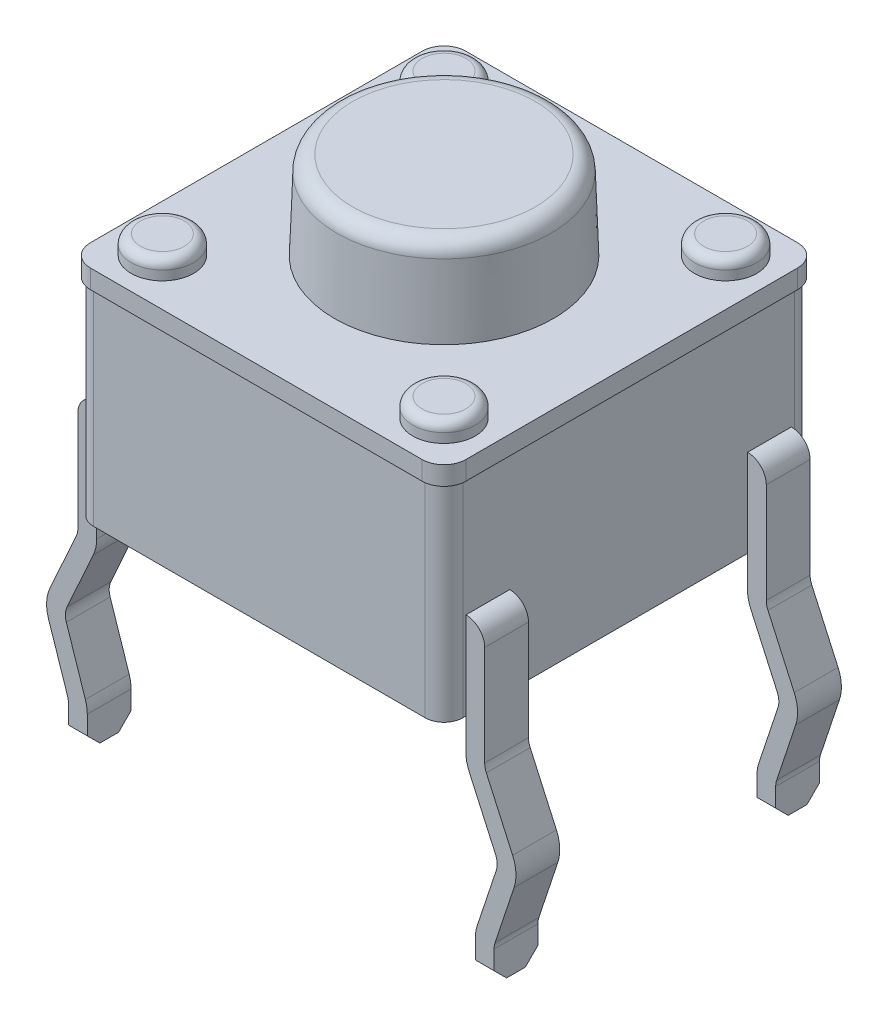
from build123d import *

# Parameters (mm, degrees)
EXTRUDE_1_DEPTH = 3.3
EXTRUDE_2_DEPTH = 0.3
EXTRUDE_START   = 2.25
EXTRUDE_3_DEPTH = 0.35
EXTRUDE_START_2 = -2.25
EXTRUDE_4_DEPTH = 0.35
CHAMFER_1_SIZE  = 0.2
SKETCH_4_R      = 1.75
EXTRUDE_5_DEPTH = 1.4
EXTRUDE_5_TAPER = 2
SKETCH_5_R      = 0.5
EXTRUDE_6_DEPTH = 0.3
FILLET_1_R      = 0.15
FILLET_2_R      = 0.25


with BuildPart() as part:
    # Sketch 1 → Extrude 1 (new body)
    with BuildSketch(Plane(origin=(0, 0, 0), x_dir=(1, 0, 0), z_dir=(0, 1, 0))):
        with BuildLine():
            Line((-2.65, -2.95), (2.65, -2.95))
            ThreePointArc((2.65, -2.95), (2.862132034, -2.862132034), (2.95, -2.65))
            Line((2.95, -2.65), (2.95, 2.65))
            ThreePointArc((2.95, 2.65), (2.862132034, 2.862132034), (2.65, 2.95))
            Line((2.65, 2.95), (-2.65, 2.95))
            ThreePointArc((-2.65, 2.95), (-2.862132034, 2.862132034), (-2.95, 2.65))
            Line((-2.95, 2.65), (-2.95, -2.65))
            ThreePointArc((-2.95, -2.65), (-2.862132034, -2.862132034), (-2.65, -2.95))
        make_face()
    extrude(amount=EXTRUDE_1_DEPTH)

    # Sketch 2 → Extrude 2 (add)
    with BuildSketch(Plane(origin=(0, 3.3, 0), x_dir=(-1, 0, 0), z_dir=(0, 1, 0))):
        with BuildLine():
            Line((3, -2.65), (3, 2.65))
            ThreePointArc((3, 2.65), (2.897487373, 2.897487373), (2.65, 3))
            Line((2.65, 3), (-2.65, 3))
            ThreePointArc((-2.65, 3), (-2.897487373, 2.897487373), (-3, 2.65))
            Line((-3, 2.65), (-3, -2.65))
            ThreePointArc((-3, -2.65), (-2.897487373, -2.897487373), (-2.65, -3))
            Line((-2.65, -3), (2.65, -3))
            ThreePointArc((2.65, -3), (2.897487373, -2.897487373), (3, -2.65))
        make_face()
    extrude(amount=EXTRUDE_2_DEPTH)

    # Sketch 3 → Extrude 3 (add, symmetric)
    with BuildSketch(Plane.XY.offset(EXTRUDE_START)):
        with BuildLine():
            Line((-2.95, 1.4), (-2.95, -0.5))
            ThreePointArc((-2.95, -0.5), (-2.963469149, -0.626418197), (-3.003271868, -0.747160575))
            Line((-3.003271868, -0.747160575), (-3.423364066, -1.676419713))
            ThreePointArc((-3.423364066, -1.676419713), (-3.449593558, -1.784389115), (-3.434727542, -1.894499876))
            Line((-3.434727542, -1.894499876), (-3.130544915, -2.811000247))
            ThreePointArc((-3.130544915, -2.811000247), (-3.107685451, -2.904273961), (-3.1, -3))
            Line((-3.1, -3), (-3.1, -3.5))
            Line((-3.1, -3.5), (-3.4, -3.5))
            Line((-3.4, -3.5), (-3.4, -3))
            ThreePointArc((-3.4, -3), (-3.403842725, -2.95213698), (-3.415272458, -2.905500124))
            Line((-3.415272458, -2.905500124), (-3.719455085, -1.988999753))
            ThreePointArc((-3.719455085, -1.988999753), (-3.749187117, -1.76877823), (-3.696728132, -1.552839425))
            Line((-3.696728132, -1.552839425), (-3.276635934, -0.623580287))
            ThreePointArc((-3.276635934, -0.623580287), (-3.256734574, -0.563209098), (-3.25, -0.5))
            Line((-3.25, -0.5), (-3.25, 1.1))
            ThreePointArc((-3.25, 1.1), (-3.162132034, 1.312132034), (-2.95, 1.4))
        make_face()
        with BuildLine():
            Line((3.4, -3.5), (3.1, -3.5))
            Line((3.1, -3.5), (3.1, -3))
            ThreePointArc((3.1, -3), (3.107685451, -2.904273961), (3.130544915, -2.811000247))
            Line((3.130544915, -2.811000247), (3.434727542, -1.894499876))
            ThreePointArc((3.434727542, -1.894499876), (3.449593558, -1.784389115), (3.423364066, -1.676419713))
            Line((3.423364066, -1.676419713), (3.003271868, -0.747160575))
            ThreePointArc((3.003271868, -0.747160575), (2.963469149, -0.626418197), (2.95, -0.5))
            Line((2.95, -0.5), (2.95, 1.4))
            ThreePointArc((2.95, 1.4), (3.162132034, 1.312132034), (3.25, 1.1))
            Line((3.25, 1.1), (3.25, -0.5))
            ThreePointArc((3.25, -0.5), (3.256734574, -0.563209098), (3.276635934, -0.623580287))
            Line((3.276635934, -0.623580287), (3.696728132, -1.552839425))
            ThreePointArc((3.696728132, -1.552839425), (3.749187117, -1.76877823), (3.719455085, -1.988999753))
            Line((3.719455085, -1.988999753), (3.415272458, -2.905500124))
            ThreePointArc((3.415272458, -2.905500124), (3.403842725, -2.95213698), (3.4, -3))
            Line((3.4, -3), (3.4, -3.5))
        make_face()
    extrude(amount=EXTRUDE_3_DEPTH, both=True)

    # Sketch 3_2 → Extrude 4 (add, symmetric)
    with BuildSketch(Plane.XY.offset(EXTRUDE_START_2)):
        with BuildLine():
            Line((-2.95, 1.4), (-2.95, -0.5))
            ThreePointArc((-2.95, -0.5), (-2.963469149, -0.626418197), (-3.003271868, -0.747160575))
            Line((-3.003271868, -0.747160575), (-3.423364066, -1.676419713))
            ThreePointArc((-3.423364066, -1.676419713), (-3.449593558, -1.784389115), (-3.434727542, -1.894499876))
            Line((-3.434727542, -1.894499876), (-3.130544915, -2.811000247))
            ThreePointArc((-3.130544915, -2.811000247), (-3.107685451, -2.904273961), (-3.1, -3))
            Line((-3.1, -3), (-3.1, -3.5))
            Line((-3.1, -3.5), (-3.4, -3.5))
            Line((-3.4, -3.5), (-3.4, -3))
            ThreePointArc((-3.4, -3), (-3.403842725, -2.95213698), (-3.415272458, -2.905500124))
            Line((-3.415272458, -2.905500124), (-3.719455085, -1.988999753))
            ThreePointArc((-3.719455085, -1.988999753), (-3.749187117, -1.76877823), (-3.696728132, -1.552839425))
            Line((-3.696728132, -1.552839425), (-3.276635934, -0.623580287))
            ThreePointArc((-3.276635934, -0.623580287), (-3.256734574, -0.563209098), (-3.25, -0.5))
            Line((-3.25, -0.5), (-3.25, 1.1))
            ThreePointArc((-3.25, 1.1), (-3.162132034, 1.312132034), (-2.95, 1.4))
        make_face()
        with BuildLine():
            Line((3.4, -3.5), (3.1, -3.5))
            Line((3.1, -3.5), (3.1, -3))
            ThreePointArc((3.1, -3), (3.107685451, -2.904273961), (3.130544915, -2.811000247))
            Line((3.130544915, -2.811000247), (3.434727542, -1.894499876))
            ThreePointArc((3.434727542, -1.894499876), (3.449593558, -1.784389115), (3.423364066, -1.676419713))
            Line((3.423364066, -1.676419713), (3.003271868, -0.747160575))
            ThreePointArc((3.003271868, -0.747160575), (2.963469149, -0.626418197), (2.95, -0.5))
            Line((2.95, -0.5), (2.95, 1.4))
            ThreePointArc((2.95, 1.4), (3.162132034, 1.312132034), (3.25, 1.1))
            Line((3.25, 1.1), (3.25, -0.5))
            ThreePointArc((3.25, -0.5), (3.256734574, -0.563209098), (3.276635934, -0.623580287))
            Line((3.276635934, -0.623580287), (3.696728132, -1.552839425))
            ThreePointArc((3.696728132, -1.552839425), (3.749187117, -1.76877823), (3.719455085, -1.988999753))
            Line((3.719455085, -1.988999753), (3.415272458, -2.905500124))
            ThreePointArc((3.415272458, -2.905500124), (3.403842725, -2.95213698), (3.4, -3))
            Line((3.4, -3), (3.4, -3.5))
        make_face()
    extrude(amount=EXTRUDE_4_DEPTH, both=True)

    # Chamfer 1
    chamfer_1_edges = [part.edges().sort_by_distance(p)[0] for p in [
        (-3.25, -3.5, -2.6),
        (-3.25, -3.5, -1.9),
        (3.25, -3.5, -2.6),
        (3.25, -3.5, -1.9),
        (-3.25, -3.5, 1.9),
        (-3.25, -3.5, 2.6),
        (3.25, -3.5, 1.9),
        (3.25, -3.5, 2.6),
    ]]
    chamfer(chamfer_1_edges, length=CHAMFER_1_SIZE)

    # Sketch 4 → Extrude 5 (add)
    with BuildSketch(Plane(origin=(0, 3.6, 0), x_dir=(-1, 0, 0), z_dir=(0, 1, 0))):
        Circle(SKETCH_4_R)
    extrude(amount=EXTRUDE_5_DEPTH, taper=EXTRUDE_5_TAPER)

    # Sketch 5 → Extrude 6 (add)
    with BuildSketch(Plane(origin=(0, 3.6, 0), x_dir=(-1, 0, 0), z_dir=(0, 1, 0))):
        with Locations(Location((2.25, -2.25, 0), (0, 0, 90))):
            Circle(SKETCH_5_R)
        with Locations(Location((-2.25, -2.25, 0), (0, 0, 270))):
            Circle(SKETCH_5_R)
        with Locations(Location((-2.25, 2.25, 0), (0, 0, 90))):
            Circle(SKETCH_5_R)
        with Locations(Location((2.25, 2.25, 0), (0, 0, 270))):
            Circle(SKETCH_5_R)
    extrude(amount=EXTRUDE_6_DEPTH)

    # Fillet 1
    fillet_1_edges = [part.edges().sort_by_distance(p)[0] for p in [
        (-2.25, 3.9, -2.75),
        (2.25, 3.9, -1.75),
        (2.25, 3.9, 1.75),
        (-2.25, 3.9, 2.75),
    ]]
    fillet(fillet_1_edges, radius=FILLET_1_R)

    # Fillet 2
    fillet_2_edges = [part.edges().sort_by_distance(p)[0] for p in [
        (1.701110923, 5, 0),
    ]]
    fillet(fillet_2_edges, radius=FILLET_2_R)


solid = part.part
